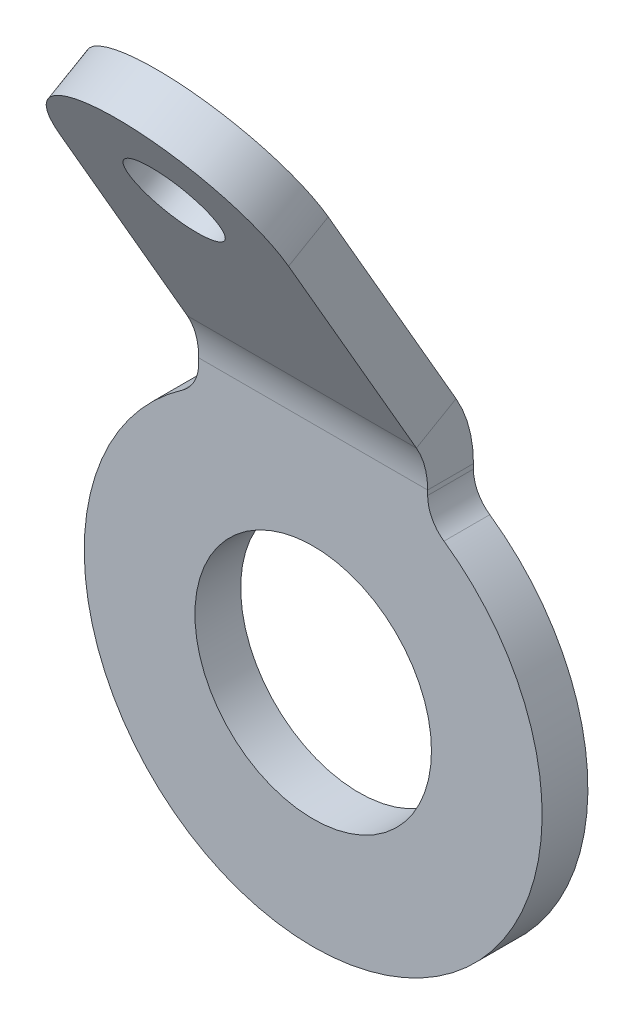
ISO-10303-21;
HEADER;
FILE_DESCRIPTION(('STEP AP214'),'2;1');
FILE_NAME('part.step','',(''),(''),'','','');
FILE_SCHEMA(('AUTOMOTIVE_DESIGN { 1 0 10303 214 1 1 1 1 }'));
ENDSEC;
DATA;
#1=APPLICATION_CONTEXT('core data for automotive mechanical design processes');
#2=APPLICATION_PROTOCOL_DEFINITION('international standard','automotive_design',2000,#1);
#3=PRODUCT_CONTEXT('',#1,'mechanical');
#4=PRODUCT('Part','Part','',(#3));
#5=PRODUCT_RELATED_PRODUCT_CATEGORY('part','',(#4));
#6=PRODUCT_DEFINITION_FORMATION('','',#4);
#7=PRODUCT_DEFINITION_CONTEXT('part definition',#1,'design');
#8=PRODUCT_DEFINITION('design','',#6,#7);
#9=PRODUCT_DEFINITION_SHAPE('','',#8);
#10=(LENGTH_UNIT() NAMED_UNIT(*) SI_UNIT(.MILLI.,.METRE.));
#11=(NAMED_UNIT(*) PLANE_ANGLE_UNIT() SI_UNIT($,.RADIAN.));
#12=(NAMED_UNIT(*) SI_UNIT($,.STERADIAN.) SOLID_ANGLE_UNIT());
#13=UNCERTAINTY_MEASURE_WITH_UNIT(LENGTH_MEASURE(1.E-05),#10,'distance_accuracy_value','');
#14=(GEOMETRIC_REPRESENTATION_CONTEXT(3) GLOBAL_UNCERTAINTY_ASSIGNED_CONTEXT((#13)) GLOBAL_UNIT_ASSIGNED_CONTEXT((#10,
#11,#12)) REPRESENTATION_CONTEXT('',''));
#15=CARTESIAN_POINT('',(0.,0.,0.));
#16=DIRECTION('',(0.,0.,1.));
#17=DIRECTION('',(1.,0.,0.));
#18=AXIS2_PLACEMENT_3D('',#15,#16,#17);
#19=CARTESIAN_POINT('',(0.,6.38605231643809,1.82237794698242));
#20=DIRECTION('',(0.,0.500000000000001,-0.866025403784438));
#21=DIRECTION('',(-1.,0.,0.));
#22=AXIS2_PLACEMENT_3D('',#19,#20,#21);
#23=PLANE('',#22);
#24=CARTESIAN_POINT('',(0.,6.38605231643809,1.82237794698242));
#25=DIRECTION('',(0.,-0.500000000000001,0.866025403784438));
#26=DIRECTION('',(1.,0.,0.));
#27=AXIS2_PLACEMENT_3D('',#24,#25,#26);
#28=CIRCLE('',#27,0.6);
#29=CARTESIAN_POINT('',(0.6,6.38605231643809,1.82237794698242));
#30=VERTEX_POINT('',#29);
#31=EDGE_CURVE('E184',#30,#30,#28,.T.);
#32=ORIENTED_EDGE('',*,*,#31,.F.);
#33=EDGE_LOOP('',(#32));
#34=FACE_BOUND('',#33,.T.);
#35=DIRECTION('',(0.,-0.866025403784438,-0.500000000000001));
#36=VECTOR('',#35,1.);
#37=CARTESIAN_POINT('',(-1.5,2.57387448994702,-0.378583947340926));
#38=LINE('',#37,#36);
#39=CARTESIAN_POINT('',(-1.5,6.38605231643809,1.82237794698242));
#40=VERTEX_POINT('',#39);
#41=CARTESIAN_POINT('',(-1.5,3.48485700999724,0.147372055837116));
#42=VERTEX_POINT('',#41);
#43=EDGE_CURVE('E59',#40,#42,#38,.T.);
#44=ORIENTED_EDGE('',*,*,#43,.T.);
#45=DIRECTION('',(1.,0.,0.));
#46=VECTOR('',#45,1.);
#47=CARTESIAN_POINT('',(0.,3.48485700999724,0.147372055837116));
#48=LINE('',#47,#46);
#49=CARTESIAN_POINT('',(1.5,3.48485700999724,0.147372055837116));
#50=VERTEX_POINT('',#49);
#51=EDGE_CURVE('E51',#42,#50,#48,.T.);
#52=ORIENTED_EDGE('',*,*,#51,.T.);
#53=DIRECTION('',(0.,0.866025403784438,0.500000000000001));
#54=VECTOR('',#53,1.);
#55=CARTESIAN_POINT('',(1.5,2.57387448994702,-0.378583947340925));
#56=LINE('',#55,#54);
#57=CARTESIAN_POINT('',(1.5,6.38605231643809,1.82237794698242));
#58=VERTEX_POINT('',#57);
#59=EDGE_CURVE('E67',#50,#58,#56,.T.);
#60=ORIENTED_EDGE('',*,*,#59,.T.);
#61=CARTESIAN_POINT('',(0.,6.38605231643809,1.82237794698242));
#62=DIRECTION('',(0.,-0.500000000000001,0.866025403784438));
#63=DIRECTION('',(-1.,0.,0.));
#64=AXIS2_PLACEMENT_3D('',#61,#62,#63);
#65=CIRCLE('',#64,1.5);
#66=EDGE_CURVE('E183',#58,#40,#65,.T.);
#67=ORIENTED_EDGE('',*,*,#66,.T.);
#68=EDGE_LOOP('',(#44,#52,#60,#67));
#69=FACE_BOUND('',#68,.T.);
#70=ADVANCED_FACE('F42',(#34,#69),#23,.F.);
#71=CARTESIAN_POINT('',(0.,6.68605231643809,1.30276270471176));
#72=DIRECTION('',(0.,-0.500000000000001,0.866025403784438));
#73=DIRECTION('',(1.,0.,0.));
#74=AXIS2_PLACEMENT_3D('',#71,#72,#73);
#75=CYLINDRICAL_SURFACE('',#74,1.5);
#76=ORIENTED_EDGE('',*,*,#66,.F.);
#77=DIRECTION('',(0.,-0.500000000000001,0.866025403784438));
#78=VECTOR('',#77,1.);
#79=CARTESIAN_POINT('',(1.5,6.68605231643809,1.30276270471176));
#80=LINE('',#79,#78);
#81=CARTESIAN_POINT('',(1.5,6.68605231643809,1.30276270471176));
#82=VERTEX_POINT('',#81);
#83=EDGE_CURVE('E193',#82,#58,#80,.T.);
#84=ORIENTED_EDGE('',*,*,#83,.F.);
#85=CARTESIAN_POINT('',(0.,6.68605231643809,1.30276270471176));
#86=DIRECTION('',(0.,-0.500000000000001,0.866025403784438));
#87=DIRECTION('',(-1.,0.,0.));
#88=AXIS2_PLACEMENT_3D('',#85,#86,#87);
#89=CIRCLE('',#88,1.5);
#90=CARTESIAN_POINT('',(-1.5,6.68605231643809,1.30276270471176));
#91=VERTEX_POINT('',#90);
#92=EDGE_CURVE('E188',#82,#91,#89,.T.);
#93=ORIENTED_EDGE('',*,*,#92,.T.);
#94=DIRECTION('',(0.,-0.500000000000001,0.866025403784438));
#95=VECTOR('',#94,1.);
#96=CARTESIAN_POINT('',(-1.5,6.68605231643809,1.30276270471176));
#97=LINE('',#96,#95);
#98=EDGE_CURVE('E195',#91,#40,#97,.T.);
#99=ORIENTED_EDGE('',*,*,#98,.T.);
#100=EDGE_LOOP('',(#76,#84,#93,#99));
#101=FACE_BOUND('',#100,.T.);
#102=ADVANCED_FACE('F210',(#101),#75,.T.);
#103=CARTESIAN_POINT('',(1.5,2.87387448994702,-0.898199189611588));
#104=DIRECTION('',(1.,0.,0.));
#105=DIRECTION('',(0.,0.866025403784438,0.500000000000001));
#106=AXIS2_PLACEMENT_3D('',#103,#104,#105);
#107=PLANE('',#106);
#108=DIRECTION('',(0.,-0.500000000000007,0.866025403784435));
#109=VECTOR('',#108,1.);
#110=CARTESIAN_POINT('',(1.5,3.78485700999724,-0.372243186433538));
#111=LINE('',#110,#109);
#112=CARTESIAN_POINT('',(1.5,3.78485700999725,-0.372243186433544));
#113=VERTEX_POINT('',#112);
#114=EDGE_CURVE('E198',#113,#50,#111,.T.);
#115=ORIENTED_EDGE('',*,*,#114,.F.);
#116=DIRECTION('',(0.,0.866025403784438,0.500000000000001));
#117=VECTOR('',#116,1.);
#118=CARTESIAN_POINT('',(1.5,2.87387448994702,-0.898199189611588));
#119=LINE('',#118,#117);
#120=EDGE_CURVE('E46',#113,#82,#119,.T.);
#121=ORIENTED_EDGE('',*,*,#120,.T.);
#122=ORIENTED_EDGE('',*,*,#83,.T.);
#123=ORIENTED_EDGE('',*,*,#59,.F.);
#124=EDGE_LOOP('',(#115,#121,#122,#123));
#125=FACE_BOUND('',#124,.T.);
#126=ADVANCED_FACE('F206',(#125),#107,.T.);
#127=CARTESIAN_POINT('',(-1.5,2.87387448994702,-0.898199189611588));
#128=DIRECTION('',(-1.,0.,0.));
#129=DIRECTION('',(0.,-0.866025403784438,-0.500000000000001));
#130=AXIS2_PLACEMENT_3D('',#127,#128,#129);
#131=PLANE('',#130);
#132=DIRECTION('',(0.,0.500000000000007,-0.866025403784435));
#133=VECTOR('',#132,1.);
#134=CARTESIAN_POINT('',(-1.5,3.78485700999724,-0.372243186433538));
#135=LINE('',#134,#133);
#136=CARTESIAN_POINT('',(-1.5,3.78485700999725,-0.372243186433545));
#137=VERTEX_POINT('',#136);
#138=EDGE_CURVE('E12',#42,#137,#135,.T.);
#139=ORIENTED_EDGE('',*,*,#138,.F.);
#140=ORIENTED_EDGE('',*,*,#43,.F.);
#141=ORIENTED_EDGE('',*,*,#98,.F.);
#142=DIRECTION('',(0.,-0.866025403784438,-0.500000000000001));
#143=VECTOR('',#142,1.);
#144=CARTESIAN_POINT('',(-1.5,2.87387448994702,-0.898199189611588));
#145=LINE('',#144,#143);
#146=EDGE_CURVE('E191',#91,#137,#145,.T.);
#147=ORIENTED_EDGE('',*,*,#146,.T.);
#148=EDGE_LOOP('',(#139,#140,#141,#147));
#149=FACE_BOUND('',#148,.T.);
#150=ADVANCED_FACE('F44',(#149),#131,.T.);
#151=CARTESIAN_POINT('',(0.,6.68605231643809,1.30276270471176));
#152=DIRECTION('',(0.,0.500000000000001,-0.866025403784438));
#153=DIRECTION('',(-1.,0.,0.));
#154=AXIS2_PLACEMENT_3D('',#151,#152,#153);
#155=PLANE('',#154);
#156=DIRECTION('',(1.,0.,0.));
#157=VECTOR('',#156,1.);
#158=CARTESIAN_POINT('',(0.,3.78485700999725,-0.372243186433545));
#159=LINE('',#158,#157);
#160=EDGE_CURVE('E143',#137,#113,#159,.T.);
#161=ORIENTED_EDGE('',*,*,#160,.F.);
#162=ORIENTED_EDGE('',*,*,#146,.F.);
#163=ORIENTED_EDGE('',*,*,#92,.F.);
#164=ORIENTED_EDGE('',*,*,#120,.F.);
#165=EDGE_LOOP('',(#161,#162,#163,#164));
#166=FACE_BOUND('',#165,.T.);
#167=CARTESIAN_POINT('',(0.,6.68605231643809,1.30276270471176));
#168=DIRECTION('',(0.,-0.500000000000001,0.866025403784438));
#169=DIRECTION('',(1.,0.,0.));
#170=AXIS2_PLACEMENT_3D('',#167,#168,#169);
#171=CIRCLE('',#170,0.6);
#172=CARTESIAN_POINT('',(0.6,6.68605231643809,1.30276270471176));
#173=VERTEX_POINT('',#172);
#174=EDGE_CURVE('E180',#173,#173,#171,.T.);
#175=ORIENTED_EDGE('',*,*,#174,.T.);
#176=EDGE_LOOP('',(#175));
#177=FACE_BOUND('',#176,.T.);
#178=ADVANCED_FACE('F280',(#166,#177),#155,.T.);
#179=CARTESIAN_POINT('',(0.,6.68605231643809,1.30276270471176));
#180=DIRECTION('',(0.,-0.500000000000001,0.866025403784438));
#181=DIRECTION('',(1.,0.,0.));
#182=AXIS2_PLACEMENT_3D('',#179,#180,#181);
#183=CYLINDRICAL_SURFACE('',#182,0.6);
#184=ORIENTED_EDGE('',*,*,#174,.F.);
#185=EDGE_LOOP('',(#184));
#186=FACE_BOUND('',#185,.T.);
#187=ORIENTED_EDGE('',*,*,#31,.T.);
#188=EDGE_LOOP('',(#187));
#189=FACE_BOUND('',#188,.T.);
#190=ADVANCED_FACE('F282',(#186,#189),#183,.F.);
#191=CARTESIAN_POINT('',(-2.,2.87228132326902,-0.6));
#192=DIRECTION('',(0.,0.,1.));
#193=DIRECTION('',(1.,0.,0.));
#194=AXIS2_PLACEMENT_3D('',#191,#192,#193);
#195=CYLINDRICAL_SURFACE('',#194,0.5);
#196=CARTESIAN_POINT('',(-2.,2.87228132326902,-0.6));
#197=DIRECTION('',(0.,0.,-1.));
#198=DIRECTION('',(-1.,0.,0.));
#199=AXIS2_PLACEMENT_3D('',#196,#197,#198);
#200=CIRCLE('',#199,0.5);
#201=CARTESIAN_POINT('',(-1.71428571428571,2.46195541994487,-0.6));
#202=VERTEX_POINT('',#201);
#203=CARTESIAN_POINT('',(-1.5,2.87228132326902,-0.6));
#204=VERTEX_POINT('',#203);
#205=EDGE_CURVE('E160',#202,#204,#200,.F.);
#206=ORIENTED_EDGE('',*,*,#205,.F.);
#207=DIRECTION('',(0.,0.,1.));
#208=VECTOR('',#207,1.);
#209=CARTESIAN_POINT('',(-1.71428571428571,2.46195541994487,-0.6));
#210=LINE('',#209,#208);
#211=CARTESIAN_POINT('',(-1.71428571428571,2.46195541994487,0.));
#212=VERTEX_POINT('',#211);
#213=EDGE_CURVE('E171',#212,#202,#210,.F.);
#214=ORIENTED_EDGE('',*,*,#213,.F.);
#215=CARTESIAN_POINT('',(-2.,2.87228132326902,0.));
#216=DIRECTION('',(0.,0.,-1.));
#217=DIRECTION('',(-1.,0.,0.));
#218=AXIS2_PLACEMENT_3D('',#215,#216,#217);
#219=CIRCLE('',#218,0.5);
#220=CARTESIAN_POINT('',(-1.5,2.87228132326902,0.));
#221=VERTEX_POINT('',#220);
#222=EDGE_CURVE('E238',#221,#212,#219,.T.);
#223=ORIENTED_EDGE('',*,*,#222,.F.);
#224=DIRECTION('',(0.,0.,-1.));
#225=VECTOR('',#224,1.);
#226=CARTESIAN_POINT('',(-1.5,2.87228132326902,0.));
#227=LINE('',#226,#225);
#228=EDGE_CURVE('E187',#204,#221,#227,.F.);
#229=ORIENTED_EDGE('',*,*,#228,.F.);
#230=EDGE_LOOP('',(#206,#214,#223,#229));
#231=FACE_BOUND('',#230,.T.);
#232=ADVANCED_FACE('F252',(#231),#195,.F.);
#233=CARTESIAN_POINT('',(0.,0.,-0.6));
#234=DIRECTION('',(0.,0.,1.));
#235=DIRECTION('',(1.,0.,0.));
#236=AXIS2_PLACEMENT_3D('',#233,#234,#235);
#237=CYLINDRICAL_SURFACE('',#236,3.);
#238=CARTESIAN_POINT('',(0.,0.,-0.6));
#239=DIRECTION('',(0.,0.,1.));
#240=DIRECTION('',(1.,0.,0.));
#241=AXIS2_PLACEMENT_3D('',#238,#239,#240);
#242=CIRCLE('',#241,3.);
#243=CARTESIAN_POINT('',(1.71428571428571,2.46195541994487,-0.6));
#244=VERTEX_POINT('',#243);
#245=EDGE_CURVE('E176',#202,#244,#242,.T.);
#246=ORIENTED_EDGE('',*,*,#245,.T.);
#247=DIRECTION('',(0.,0.,1.));
#248=VECTOR('',#247,1.);
#249=CARTESIAN_POINT('',(1.71428571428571,2.46195541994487,-0.6));
#250=LINE('',#249,#248);
#251=CARTESIAN_POINT('',(1.71428571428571,2.46195541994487,0.));
#252=VERTEX_POINT('',#251);
#253=EDGE_CURVE('E173',#244,#252,#250,.T.);
#254=ORIENTED_EDGE('',*,*,#253,.T.);
#255=CARTESIAN_POINT('',(0.,0.,0.));
#256=DIRECTION('',(0.,0.,1.));
#257=DIRECTION('',(1.,0.,0.));
#258=AXIS2_PLACEMENT_3D('',#255,#256,#257);
#259=CIRCLE('',#258,3.);
#260=EDGE_CURVE('E235',#212,#252,#259,.T.);
#261=ORIENTED_EDGE('',*,*,#260,.F.);
#262=ORIENTED_EDGE('',*,*,#213,.T.);
#263=EDGE_LOOP('',(#246,#254,#261,#262));
#264=FACE_BOUND('',#263,.T.);
#265=ADVANCED_FACE('F257',(#264),#237,.T.);
#266=CARTESIAN_POINT('',(2.,2.87228132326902,-0.6));
#267=DIRECTION('',(0.,0.,1.));
#268=DIRECTION('',(1.,0.,0.));
#269=AXIS2_PLACEMENT_3D('',#266,#267,#268);
#270=CYLINDRICAL_SURFACE('',#269,0.5);
#271=CARTESIAN_POINT('',(2.,2.87228132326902,-0.6));
#272=DIRECTION('',(0.,0.,-1.));
#273=DIRECTION('',(-1.,0.,0.));
#274=AXIS2_PLACEMENT_3D('',#271,#272,#273);
#275=CIRCLE('',#274,0.5);
#276=CARTESIAN_POINT('',(1.5,2.87228132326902,-0.6));
#277=VERTEX_POINT('',#276);
#278=EDGE_CURVE('E155',#277,#244,#275,.F.);
#279=ORIENTED_EDGE('',*,*,#278,.F.);
#280=DIRECTION('',(0.,0.,-1.));
#281=VECTOR('',#280,1.);
#282=CARTESIAN_POINT('',(1.5,2.87228132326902,-0.6));
#283=LINE('',#282,#281);
#284=CARTESIAN_POINT('',(1.5,2.87228132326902,0.));
#285=VERTEX_POINT('',#284);
#286=EDGE_CURVE('E133',#285,#277,#283,.T.);
#287=ORIENTED_EDGE('',*,*,#286,.F.);
#288=CARTESIAN_POINT('',(2.,2.87228132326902,0.));
#289=DIRECTION('',(0.,0.,-1.));
#290=DIRECTION('',(-1.,0.,0.));
#291=AXIS2_PLACEMENT_3D('',#288,#289,#290);
#292=CIRCLE('',#291,0.5);
#293=EDGE_CURVE('E233',#252,#285,#292,.T.);
#294=ORIENTED_EDGE('',*,*,#293,.F.);
#295=ORIENTED_EDGE('',*,*,#253,.F.);
#296=EDGE_LOOP('',(#279,#287,#294,#295));
#297=FACE_BOUND('',#296,.T.);
#298=ADVANCED_FACE('F259',(#297),#270,.F.);
#299=CARTESIAN_POINT('',(0.,0.,-0.6));
#300=DIRECTION('',(0.,0.,1.));
#301=DIRECTION('',(1.,0.,0.));
#302=AXIS2_PLACEMENT_3D('',#299,#300,#301);
#303=CYLINDRICAL_SURFACE('',#302,1.55);
#304=CARTESIAN_POINT('',(0.,0.,-0.6));
#305=DIRECTION('',(0.,0.,1.));
#306=DIRECTION('',(1.,0.,0.));
#307=AXIS2_PLACEMENT_3D('',#304,#305,#306);
#308=CIRCLE('',#307,1.55);
#309=CARTESIAN_POINT('',(1.55,0.,-0.6));
#310=VERTEX_POINT('',#309);
#311=EDGE_CURVE('E156',#310,#310,#308,.T.);
#312=ORIENTED_EDGE('',*,*,#311,.F.);
#313=EDGE_LOOP('',(#312));
#314=FACE_BOUND('',#313,.T.);
#315=CARTESIAN_POINT('',(0.,0.,0.));
#316=DIRECTION('',(0.,0.,1.));
#317=DIRECTION('',(1.,0.,0.));
#318=AXIS2_PLACEMENT_3D('',#315,#316,#317);
#319=CIRCLE('',#318,1.55);
#320=CARTESIAN_POINT('',(1.55,0.,0.));
#321=VERTEX_POINT('',#320);
#322=EDGE_CURVE('E168',#321,#321,#319,.T.);
#323=ORIENTED_EDGE('',*,*,#322,.T.);
#324=EDGE_LOOP('',(#323));
#325=FACE_BOUND('',#324,.T.);
#326=ADVANCED_FACE('F261',(#314,#325),#303,.F.);
#327=CARTESIAN_POINT('',(0.,7.,-0.6));
#328=DIRECTION('',(0.,0.,-1.));
#329=DIRECTION('',(-1.,0.,0.));
#330=AXIS2_PLACEMENT_3D('',#327,#328,#329);
#331=PLANE('',#330);
#332=ORIENTED_EDGE('',*,*,#311,.T.);
#333=EDGE_LOOP('',(#332));
#334=FACE_BOUND('',#333,.T.);
#335=DIRECTION('',(0.,-1.,0.));
#336=VECTOR('',#335,1.);
#337=CARTESIAN_POINT('',(-1.5,2.59807621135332,-0.6));
#338=LINE('',#337,#336);
#339=CARTESIAN_POINT('',(-1.5,2.93485700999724,-0.6));
#340=VERTEX_POINT('',#339);
#341=EDGE_CURVE('E153',#340,#204,#338,.T.);
#342=ORIENTED_EDGE('',*,*,#341,.F.);
#343=DIRECTION('',(1.,0.,0.));
#344=VECTOR('',#343,1.);
#345=CARTESIAN_POINT('',(0.,2.93485700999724,-0.6));
#346=LINE('',#345,#344);
#347=CARTESIAN_POINT('',(1.5,2.93485700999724,-0.6));
#348=VERTEX_POINT('',#347);
#349=EDGE_CURVE('E141',#340,#348,#346,.T.);
#350=ORIENTED_EDGE('',*,*,#349,.T.);
#351=DIRECTION('',(0.,1.,0.));
#352=VECTOR('',#351,1.);
#353=CARTESIAN_POINT('',(1.5,2.59807621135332,-0.6));
#354=LINE('',#353,#352);
#355=EDGE_CURVE('E134',#277,#348,#354,.T.);
#356=ORIENTED_EDGE('',*,*,#355,.F.);
#357=ORIENTED_EDGE('',*,*,#278,.T.);
#358=ORIENTED_EDGE('',*,*,#245,.F.);
#359=ORIENTED_EDGE('',*,*,#205,.T.);
#360=EDGE_LOOP('',(#342,#350,#356,#357,#358,#359));
#361=FACE_BOUND('',#360,.T.);
#362=ADVANCED_FACE('F150',(#334,#361),#331,.T.);
#363=CARTESIAN_POINT('',(1.5,2.59807621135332,-0.6));
#364=DIRECTION('',(1.,0.,0.));
#365=DIRECTION('',(0.,1.,0.));
#366=AXIS2_PLACEMENT_3D('',#363,#364,#365);
#367=PLANE('',#366);
#368=ORIENTED_EDGE('',*,*,#355,.T.);
#369=DIRECTION('',(0.,0.,1.));
#370=VECTOR('',#369,1.);
#371=CARTESIAN_POINT('',(1.5,2.93485700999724,-0.599999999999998));
#372=LINE('',#371,#370);
#373=CARTESIAN_POINT('',(1.5,2.93485700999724,0.));
#374=VERTEX_POINT('',#373);
#375=EDGE_CURVE('E122',#348,#374,#372,.T.);
#376=ORIENTED_EDGE('',*,*,#375,.T.);
#377=DIRECTION('',(0.,1.,0.));
#378=VECTOR('',#377,1.);
#379=CARTESIAN_POINT('',(1.5,2.59807621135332,0.));
#380=LINE('',#379,#378);
#381=EDGE_CURVE('E230',#285,#374,#380,.T.);
#382=ORIENTED_EDGE('',*,*,#381,.F.);
#383=ORIENTED_EDGE('',*,*,#286,.T.);
#384=EDGE_LOOP('',(#368,#376,#382,#383));
#385=FACE_BOUND('',#384,.T.);
#386=ADVANCED_FACE('F158',(#385),#367,.T.);
#387=CARTESIAN_POINT('',(0.,7.,0.));
#388=DIRECTION('',(0.,0.,-1.));
#389=DIRECTION('',(-1.,0.,0.));
#390=AXIS2_PLACEMENT_3D('',#387,#388,#389);
#391=PLANE('',#390);
#392=DIRECTION('',(1.,0.,0.));
#393=VECTOR('',#392,1.);
#394=CARTESIAN_POINT('',(0.,2.93485700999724,0.));
#395=LINE('',#394,#393);
#396=CARTESIAN_POINT('',(-1.5,2.93485700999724,0.));
#397=VERTEX_POINT('',#396);
#398=EDGE_CURVE('E144',#397,#374,#395,.T.);
#399=ORIENTED_EDGE('',*,*,#398,.F.);
#400=DIRECTION('',(0.,-1.,0.));
#401=VECTOR('',#400,1.);
#402=CARTESIAN_POINT('',(-1.5,2.59807621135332,0.));
#403=LINE('',#402,#401);
#404=EDGE_CURVE('E240',#397,#221,#403,.T.);
#405=ORIENTED_EDGE('',*,*,#404,.T.);
#406=ORIENTED_EDGE('',*,*,#222,.T.);
#407=ORIENTED_EDGE('',*,*,#260,.T.);
#408=ORIENTED_EDGE('',*,*,#293,.T.);
#409=ORIENTED_EDGE('',*,*,#381,.T.);
#410=EDGE_LOOP('',(#399,#405,#406,#407,#408,#409));
#411=FACE_BOUND('',#410,.T.);
#412=ORIENTED_EDGE('',*,*,#322,.F.);
#413=EDGE_LOOP('',(#412));
#414=FACE_BOUND('',#413,.T.);
#415=ADVANCED_FACE('F244',(#411,#414),#391,.F.);
#416=CARTESIAN_POINT('',(-1.5,2.59807621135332,-0.6));
#417=DIRECTION('',(-1.,0.,0.));
#418=DIRECTION('',(0.,-1.,0.));
#419=AXIS2_PLACEMENT_3D('',#416,#417,#418);
#420=PLANE('',#419);
#421=ORIENTED_EDGE('',*,*,#404,.F.);
#422=DIRECTION('',(0.,0.,-1.));
#423=VECTOR('',#422,1.);
#424=CARTESIAN_POINT('',(-1.5,2.93485700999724,-0.599999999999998));
#425=LINE('',#424,#423);
#426=EDGE_CURVE('E221',#397,#340,#425,.T.);
#427=ORIENTED_EDGE('',*,*,#426,.T.);
#428=ORIENTED_EDGE('',*,*,#341,.T.);
#429=ORIENTED_EDGE('',*,*,#228,.T.);
#430=EDGE_LOOP('',(#421,#427,#428,#429));
#431=FACE_BOUND('',#430,.T.);
#432=ADVANCED_FACE('F253',(#431),#420,.T.);
#433=CARTESIAN_POINT('',(-1.5,2.93485700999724,1.1));
#434=DIRECTION('',(-1.,0.,0.));
#435=DIRECTION('',(0.,0.,1.));
#436=AXIS2_PLACEMENT_3D('',#433,#434,#435);
#437=PLANE('',#436);
#438=ORIENTED_EDGE('',*,*,#426,.F.);
#439=CARTESIAN_POINT('',(-1.5,2.93485700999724,1.1));
#440=DIRECTION('',(1.,0.,0.));
#441=DIRECTION('',(0.,0.,-1.));
#442=AXIS2_PLACEMENT_3D('',#439,#440,#441);
#443=CIRCLE('',#442,1.1);
#444=EDGE_CURVE('E218',#397,#42,#443,.T.);
#445=ORIENTED_EDGE('',*,*,#444,.T.);
#446=ORIENTED_EDGE('',*,*,#138,.T.);
#447=CARTESIAN_POINT('',(-1.5,2.93485700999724,1.1));
#448=DIRECTION('',(1.,0.,0.));
#449=DIRECTION('',(0.,0.,1.));
#450=AXIS2_PLACEMENT_3D('',#447,#448,#449);
#451=CIRCLE('',#450,1.7);
#452=EDGE_CURVE('E145',#340,#137,#451,.T.);
#453=ORIENTED_EDGE('',*,*,#452,.F.);
#454=EDGE_LOOP('',(#438,#445,#446,#453));
#455=FACE_BOUND('',#454,.T.);
#456=ADVANCED_FACE('F220',(#455),#437,.T.);
#457=CARTESIAN_POINT('',(1.5,2.93485700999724,1.1));
#458=DIRECTION('',(1.,0.,0.));
#459=DIRECTION('',(0.,0.,-1.));
#460=AXIS2_PLACEMENT_3D('',#457,#458,#459);
#461=PLANE('',#460);
#462=CARTESIAN_POINT('',(1.5,2.93485700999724,1.1));
#463=DIRECTION('',(1.,0.,0.));
#464=DIRECTION('',(0.,0.,-1.));
#465=AXIS2_PLACEMENT_3D('',#462,#463,#464);
#466=CIRCLE('',#465,1.1);
#467=EDGE_CURVE('E128',#50,#374,#466,.F.);
#468=ORIENTED_EDGE('',*,*,#467,.T.);
#469=ORIENTED_EDGE('',*,*,#375,.F.);
#470=CARTESIAN_POINT('',(1.5,2.93485700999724,1.1));
#471=DIRECTION('',(-1.,0.,0.));
#472=DIRECTION('',(0.,0.,-1.));
#473=AXIS2_PLACEMENT_3D('',#470,#471,#472);
#474=CIRCLE('',#473,1.7);
#475=EDGE_CURVE('E126',#113,#348,#474,.T.);
#476=ORIENTED_EDGE('',*,*,#475,.F.);
#477=ORIENTED_EDGE('',*,*,#114,.T.);
#478=EDGE_LOOP('',(#468,#469,#476,#477));
#479=FACE_BOUND('',#478,.T.);
#480=ADVANCED_FACE('F124',(#479),#461,.T.);
#481=CARTESIAN_POINT('',(-3.14188043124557,2.93485700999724,1.1));
#482=DIRECTION('',(1.,0.,0.));
#483=DIRECTION('',(0.,0.,-1.));
#484=AXIS2_PLACEMENT_3D('',#481,#482,#483);
#485=CYLINDRICAL_SURFACE('',#484,1.7);
#486=ORIENTED_EDGE('',*,*,#160,.T.);
#487=ORIENTED_EDGE('',*,*,#475,.T.);
#488=ORIENTED_EDGE('',*,*,#349,.F.);
#489=ORIENTED_EDGE('',*,*,#452,.T.);
#490=EDGE_LOOP('',(#486,#487,#488,#489));
#491=FACE_BOUND('',#490,.T.);
#492=ADVANCED_FACE('F139',(#491),#485,.T.);
#493=CARTESIAN_POINT('',(-3.14188043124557,2.93485700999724,1.1));
#494=DIRECTION('',(1.,0.,0.));
#495=DIRECTION('',(0.,0.,-1.));
#496=AXIS2_PLACEMENT_3D('',#493,#494,#495);
#497=CYLINDRICAL_SURFACE('',#496,1.1);
#498=ORIENTED_EDGE('',*,*,#51,.F.);
#499=ORIENTED_EDGE('',*,*,#444,.F.);
#500=ORIENTED_EDGE('',*,*,#398,.T.);
#501=ORIENTED_EDGE('',*,*,#467,.F.);
#502=EDGE_LOOP('',(#498,#499,#500,#501));
#503=FACE_BOUND('',#502,.T.);
#504=ADVANCED_FACE('F217',(#503),#497,.F.);
#505=CLOSED_SHELL('',(#70,#102,#126,#150,#178,#190,#232,#265,#298,#326,#362,#386,#415,#432,#456,
#480,#492,#504));
#506=MANIFOLD_SOLID_BREP('B2',#505);
#507=ADVANCED_BREP_SHAPE_REPRESENTATION('',(#18,#506),#14);
#508=SHAPE_DEFINITION_REPRESENTATION(#9,#507);
ENDSEC;
END-ISO-10303-21;
